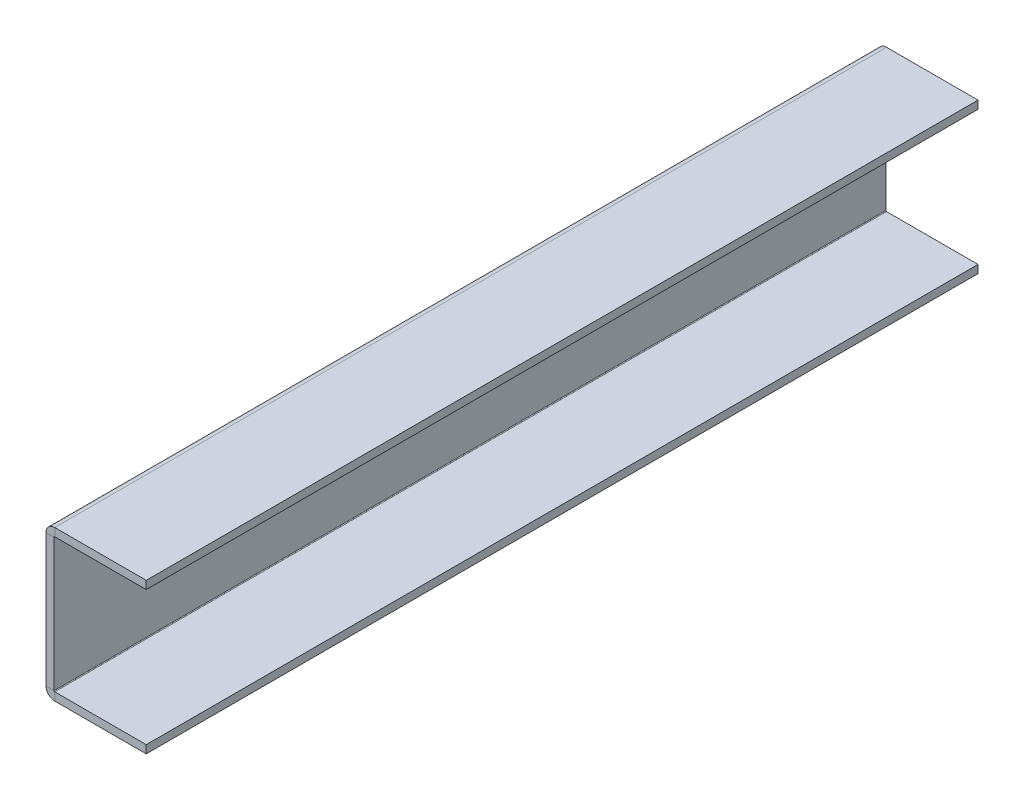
ISO-10303-21;
HEADER;
FILE_DESCRIPTION(('STEP AP214'),'2;1');
FILE_NAME('part.step','',(''),(''),'','','');
FILE_SCHEMA(('AUTOMOTIVE_DESIGN { 1 0 10303 214 1 1 1 1 }'));
ENDSEC;
DATA;
#1=APPLICATION_CONTEXT('core data for automotive mechanical design processes');
#2=APPLICATION_PROTOCOL_DEFINITION('international standard','automotive_design',2000,#1);
#3=PRODUCT_CONTEXT('',#1,'mechanical');
#4=PRODUCT('Part','Part','',(#3));
#5=PRODUCT_RELATED_PRODUCT_CATEGORY('part','',(#4));
#6=PRODUCT_DEFINITION_FORMATION('','',#4);
#7=PRODUCT_DEFINITION_CONTEXT('part definition',#1,'design');
#8=PRODUCT_DEFINITION('design','',#6,#7);
#9=PRODUCT_DEFINITION_SHAPE('','',#8);
#10=(LENGTH_UNIT() NAMED_UNIT(*) SI_UNIT(.MILLI.,.METRE.));
#11=(NAMED_UNIT(*) PLANE_ANGLE_UNIT() SI_UNIT($,.RADIAN.));
#12=(NAMED_UNIT(*) SI_UNIT($,.STERADIAN.) SOLID_ANGLE_UNIT());
#13=UNCERTAINTY_MEASURE_WITH_UNIT(LENGTH_MEASURE(1.E-05),#10,'distance_accuracy_value','');
#14=(GEOMETRIC_REPRESENTATION_CONTEXT(3) GLOBAL_UNCERTAINTY_ASSIGNED_CONTEXT((#13)) GLOBAL_UNIT_ASSIGNED_CONTEXT((#10,
#11,#12)) REPRESENTATION_CONTEXT('',''));
#15=CARTESIAN_POINT('',(0.,0.,0.));
#16=DIRECTION('',(0.,0.,1.));
#17=DIRECTION('',(1.,0.,0.));
#18=AXIS2_PLACEMENT_3D('',#15,#16,#17);
#19=CARTESIAN_POINT('',(0.,-0.7366,830.));
#20=DIRECTION('',(0.,0.,1.));
#21=DIRECTION('',(1.,0.,0.));
#22=AXIS2_PLACEMENT_3D('',#19,#20,#21);
#23=PLANE('',#22);
#24=DIRECTION('',(-1.,0.,0.));
#25=VECTOR('',#24,1.);
#26=CARTESIAN_POINT('',(0.,-0.7366,830.));
#27=LINE('',#26,#25);
#28=CARTESIAN_POINT('',(0.,-0.7366,830.));
#29=VERTEX_POINT('',#28);
#30=CARTESIAN_POINT('',(-8.,-0.736600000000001,830.));
#31=VERTEX_POINT('',#30);
#32=EDGE_CURVE('E11',#29,#31,#27,.T.);
#33=ORIENTED_EDGE('',*,*,#32,.F.);
#34=CARTESIAN_POINT('',(0.736600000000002,-0.7366,830.));
#35=DIRECTION('',(0.,0.,-1.));
#36=DIRECTION('',(-1.,0.,0.));
#37=AXIS2_PLACEMENT_3D('',#34,#35,#36);
#38=CIRCLE('',#37,0.7366);
#39=CARTESIAN_POINT('',(0.736600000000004,0.,830.));
#40=VERTEX_POINT('',#39);
#41=EDGE_CURVE('E251',#40,#29,#38,.F.);
#42=ORIENTED_EDGE('',*,*,#41,.F.);
#43=DIRECTION('',(0.,-1.,0.));
#44=VECTOR('',#43,1.);
#45=CARTESIAN_POINT('',(0.736600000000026,8.,830.));
#46=LINE('',#45,#44);
#47=CARTESIAN_POINT('',(0.736600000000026,8.,830.));
#48=VERTEX_POINT('',#47);
#49=EDGE_CURVE('E49',#48,#40,#46,.T.);
#50=ORIENTED_EDGE('',*,*,#49,.F.);
#51=CARTESIAN_POINT('',(0.736600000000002,-0.7366,830.));
#52=DIRECTION('',(0.,0.,1.));
#53=DIRECTION('',(1.,0.,0.));
#54=AXIS2_PLACEMENT_3D('',#51,#52,#53);
#55=CIRCLE('',#54,8.7366);
#56=EDGE_CURVE('E150',#48,#31,#55,.T.);
#57=ORIENTED_EDGE('',*,*,#56,.T.);
#58=EDGE_LOOP('',(#33,#42,#50,#57));
#59=FACE_BOUND('',#58,.T.);
#60=ADVANCED_FACE('F41',(#59),#23,.T.);
#61=CARTESIAN_POINT('',(0.736600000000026,8.,830.));
#62=DIRECTION('',(0.,0.,1.));
#63=DIRECTION('',(1.,0.,0.));
#64=AXIS2_PLACEMENT_3D('',#61,#62,#63);
#65=PLANE('',#64);
#66=DIRECTION('',(0.,-1.,0.));
#67=VECTOR('',#66,1.);
#68=CARTESIAN_POINT('',(0.,0.,830.));
#69=LINE('',#68,#67);
#70=CARTESIAN_POINT('',(0.,-133.2634,830.));
#71=VERTEX_POINT('',#70);
#72=EDGE_CURVE('E144',#29,#71,#69,.T.);
#73=ORIENTED_EDGE('',*,*,#72,.F.);
#74=ORIENTED_EDGE('',*,*,#32,.T.);
#75=DIRECTION('',(0.,-1.,0.));
#76=VECTOR('',#75,1.);
#77=CARTESIAN_POINT('',(-8.,0.,830.));
#78=LINE('',#77,#76);
#79=CARTESIAN_POINT('',(-7.99999999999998,-133.2634,830.));
#80=VERTEX_POINT('',#79);
#81=EDGE_CURVE('E141',#31,#80,#78,.T.);
#82=ORIENTED_EDGE('',*,*,#81,.T.);
#83=DIRECTION('',(1.,0.,0.));
#84=VECTOR('',#83,1.);
#85=CARTESIAN_POINT('',(-7.99999999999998,-133.2634,830.));
#86=LINE('',#85,#84);
#87=EDGE_CURVE('E232',#80,#71,#86,.T.);
#88=ORIENTED_EDGE('',*,*,#87,.T.);
#89=EDGE_LOOP('',(#73,#74,#82,#88));
#90=FACE_BOUND('',#89,.T.);
#91=ADVANCED_FACE('F139',(#90),#65,.T.);
#92=CARTESIAN_POINT('',(0.736600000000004,0.,0.));
#93=DIRECTION('',(0.,0.,-1.));
#94=DIRECTION('',(-1.,0.,0.));
#95=AXIS2_PLACEMENT_3D('',#92,#93,#94);
#96=PLANE('',#95);
#97=DIRECTION('',(0.,1.,0.));
#98=VECTOR('',#97,1.);
#99=CARTESIAN_POINT('',(0.736600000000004,0.,0.));
#100=LINE('',#99,#98);
#101=CARTESIAN_POINT('',(0.736600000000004,0.,0.));
#102=VERTEX_POINT('',#101);
#103=CARTESIAN_POINT('',(0.736600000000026,8.,0.));
#104=VERTEX_POINT('',#103);
#105=EDGE_CURVE('E237',#102,#104,#100,.T.);
#106=ORIENTED_EDGE('',*,*,#105,.F.);
#107=CARTESIAN_POINT('',(0.736600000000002,-0.7366,0.));
#108=DIRECTION('',(0.,0.,-1.));
#109=DIRECTION('',(-1.,0.,0.));
#110=AXIS2_PLACEMENT_3D('',#107,#108,#109);
#111=CIRCLE('',#110,0.7366);
#112=CARTESIAN_POINT('',(0.,-0.7366,0.));
#113=VERTEX_POINT('',#112);
#114=EDGE_CURVE('E189',#102,#113,#111,.F.);
#115=ORIENTED_EDGE('',*,*,#114,.T.);
#116=DIRECTION('',(1.,0.,0.));
#117=VECTOR('',#116,1.);
#118=CARTESIAN_POINT('',(-8.,-0.736600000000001,0.));
#119=LINE('',#118,#117);
#120=CARTESIAN_POINT('',(-8.,-0.736600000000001,0.));
#121=VERTEX_POINT('',#120);
#122=EDGE_CURVE('E235',#121,#113,#119,.T.);
#123=ORIENTED_EDGE('',*,*,#122,.F.);
#124=CARTESIAN_POINT('',(0.736600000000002,-0.7366,0.));
#125=DIRECTION('',(0.,0.,1.));
#126=DIRECTION('',(1.,0.,0.));
#127=AXIS2_PLACEMENT_3D('',#124,#125,#126);
#128=CIRCLE('',#127,8.7366);
#129=EDGE_CURVE('E162',#104,#121,#128,.T.);
#130=ORIENTED_EDGE('',*,*,#129,.F.);
#131=EDGE_LOOP('',(#106,#115,#123,#130));
#132=FACE_BOUND('',#131,.T.);
#133=ADVANCED_FACE('F289',(#132),#96,.T.);
#134=CARTESIAN_POINT('',(-8.,-0.736600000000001,0.));
#135=DIRECTION('',(0.,0.,-1.));
#136=DIRECTION('',(-1.,0.,0.));
#137=AXIS2_PLACEMENT_3D('',#134,#135,#136);
#138=PLANE('',#137);
#139=DIRECTION('',(-1.,0.,0.));
#140=VECTOR('',#139,1.);
#141=CARTESIAN_POINT('',(92.,0.,0.));
#142=LINE('',#141,#140);
#143=CARTESIAN_POINT('',(92.,0.,0.));
#144=VERTEX_POINT('',#143);
#145=EDGE_CURVE('E192',#144,#102,#142,.T.);
#146=ORIENTED_EDGE('',*,*,#145,.T.);
#147=ORIENTED_EDGE('',*,*,#105,.T.);
#148=DIRECTION('',(-1.,0.,0.));
#149=VECTOR('',#148,1.);
#150=CARTESIAN_POINT('',(92.,8.,0.));
#151=LINE('',#150,#149);
#152=CARTESIAN_POINT('',(92.,8.,0.));
#153=VERTEX_POINT('',#152);
#154=EDGE_CURVE('E198',#153,#104,#151,.T.);
#155=ORIENTED_EDGE('',*,*,#154,.F.);
#156=DIRECTION('',(0.,-1.,0.));
#157=VECTOR('',#156,1.);
#158=CARTESIAN_POINT('',(92.,8.,0.));
#159=LINE('',#158,#157);
#160=EDGE_CURVE('E195',#153,#144,#159,.T.);
#161=ORIENTED_EDGE('',*,*,#160,.T.);
#162=EDGE_LOOP('',(#146,#147,#155,#161));
#163=FACE_BOUND('',#162,.T.);
#164=ADVANCED_FACE('F292',(#163),#138,.T.);
#165=CARTESIAN_POINT('',(0.736600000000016,-134.,830.));
#166=DIRECTION('',(0.,0.,1.));
#167=DIRECTION('',(1.,0.,0.));
#168=AXIS2_PLACEMENT_3D('',#165,#166,#167);
#169=PLANE('',#168);
#170=DIRECTION('',(0.,-1.,0.));
#171=VECTOR('',#170,1.);
#172=CARTESIAN_POINT('',(0.736600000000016,-134.,830.));
#173=LINE('',#172,#171);
#174=CARTESIAN_POINT('',(0.736600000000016,-134.,830.));
#175=VERTEX_POINT('',#174);
#176=CARTESIAN_POINT('',(0.736600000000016,-142.,830.));
#177=VERTEX_POINT('',#176);
#178=EDGE_CURVE('E57',#175,#177,#173,.T.);
#179=ORIENTED_EDGE('',*,*,#178,.F.);
#180=CARTESIAN_POINT('',(0.736600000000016,-133.2634,830.));
#181=DIRECTION('',(0.,0.,-1.));
#182=DIRECTION('',(-1.,0.,0.));
#183=AXIS2_PLACEMENT_3D('',#180,#181,#182);
#184=CIRCLE('',#183,0.7366);
#185=EDGE_CURVE('E261',#71,#175,#184,.F.);
#186=ORIENTED_EDGE('',*,*,#185,.F.);
#187=ORIENTED_EDGE('',*,*,#87,.F.);
#188=CARTESIAN_POINT('',(0.736600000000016,-133.2634,830.));
#189=DIRECTION('',(0.,0.,1.));
#190=DIRECTION('',(1.,0.,0.));
#191=AXIS2_PLACEMENT_3D('',#188,#189,#190);
#192=CIRCLE('',#191,8.7366);
#193=EDGE_CURVE('E170',#80,#177,#192,.T.);
#194=ORIENTED_EDGE('',*,*,#193,.T.);
#195=EDGE_LOOP('',(#179,#186,#187,#194));
#196=FACE_BOUND('',#195,.T.);
#197=ADVANCED_FACE('F284',(#196),#169,.T.);
#198=CARTESIAN_POINT('',(-7.99999999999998,-133.2634,830.));
#199=DIRECTION('',(0.,0.,1.));
#200=DIRECTION('',(1.,0.,0.));
#201=AXIS2_PLACEMENT_3D('',#198,#199,#200);
#202=PLANE('',#201);
#203=DIRECTION('',(1.,0.,0.));
#204=VECTOR('',#203,1.);
#205=CARTESIAN_POINT('',(0.,-134.,830.));
#206=LINE('',#205,#204);
#207=CARTESIAN_POINT('',(92.,-134.,830.));
#208=VERTEX_POINT('',#207);
#209=EDGE_CURVE('E264',#175,#208,#206,.T.);
#210=ORIENTED_EDGE('',*,*,#209,.F.);
#211=ORIENTED_EDGE('',*,*,#178,.T.);
#212=DIRECTION('',(1.,0.,0.));
#213=VECTOR('',#212,1.);
#214=CARTESIAN_POINT('',(0.,-142.,830.));
#215=LINE('',#214,#213);
#216=CARTESIAN_POINT('',(92.,-142.,830.));
#217=VERTEX_POINT('',#216);
#218=EDGE_CURVE('E111',#177,#217,#215,.T.);
#219=ORIENTED_EDGE('',*,*,#218,.T.);
#220=DIRECTION('',(0.,-1.,0.));
#221=VECTOR('',#220,1.);
#222=CARTESIAN_POINT('',(92.,-134.,830.));
#223=LINE('',#222,#221);
#224=EDGE_CURVE('E267',#208,#217,#223,.T.);
#225=ORIENTED_EDGE('',*,*,#224,.F.);
#226=EDGE_LOOP('',(#210,#211,#219,#225));
#227=FACE_BOUND('',#226,.T.);
#228=ADVANCED_FACE('F273',(#227),#202,.T.);
#229=CARTESIAN_POINT('',(0.,-133.2634,0.));
#230=DIRECTION('',(0.,0.,-1.));
#231=DIRECTION('',(-1.,0.,0.));
#232=AXIS2_PLACEMENT_3D('',#229,#230,#231);
#233=PLANE('',#232);
#234=DIRECTION('',(-1.,0.,0.));
#235=VECTOR('',#234,1.);
#236=CARTESIAN_POINT('',(0.,-133.2634,0.));
#237=LINE('',#236,#235);
#238=CARTESIAN_POINT('',(0.,-133.2634,0.));
#239=VERTEX_POINT('',#238);
#240=CARTESIAN_POINT('',(-7.99999999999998,-133.2634,0.));
#241=VERTEX_POINT('',#240);
#242=EDGE_CURVE('E98',#239,#241,#237,.T.);
#243=ORIENTED_EDGE('',*,*,#242,.F.);
#244=CARTESIAN_POINT('',(0.736600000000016,-133.2634,0.));
#245=DIRECTION('',(0.,0.,-1.));
#246=DIRECTION('',(-1.,0.,0.));
#247=AXIS2_PLACEMENT_3D('',#244,#245,#246);
#248=CIRCLE('',#247,0.7366);
#249=CARTESIAN_POINT('',(0.736600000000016,-134.,0.));
#250=VERTEX_POINT('',#249);
#251=EDGE_CURVE('E185',#239,#250,#248,.F.);
#252=ORIENTED_EDGE('',*,*,#251,.T.);
#253=DIRECTION('',(0.,1.,0.));
#254=VECTOR('',#253,1.);
#255=CARTESIAN_POINT('',(0.736600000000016,-142.,0.));
#256=LINE('',#255,#254);
#257=CARTESIAN_POINT('',(0.736600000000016,-142.,0.));
#258=VERTEX_POINT('',#257);
#259=EDGE_CURVE('E105',#258,#250,#256,.T.);
#260=ORIENTED_EDGE('',*,*,#259,.F.);
#261=CARTESIAN_POINT('',(0.736600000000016,-133.2634,0.));
#262=DIRECTION('',(0.,0.,1.));
#263=DIRECTION('',(1.,0.,0.));
#264=AXIS2_PLACEMENT_3D('',#261,#262,#263);
#265=CIRCLE('',#264,8.7366);
#266=EDGE_CURVE('E204',#241,#258,#265,.T.);
#267=ORIENTED_EDGE('',*,*,#266,.F.);
#268=EDGE_LOOP('',(#243,#252,#260,#267));
#269=FACE_BOUND('',#268,.T.);
#270=ADVANCED_FACE('F321',(#269),#233,.T.);
#271=CARTESIAN_POINT('',(0.736600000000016,-142.,0.));
#272=DIRECTION('',(0.,0.,-1.));
#273=DIRECTION('',(-1.,0.,0.));
#274=AXIS2_PLACEMENT_3D('',#271,#272,#273);
#275=PLANE('',#274);
#276=DIRECTION('',(0.,-1.,0.));
#277=VECTOR('',#276,1.);
#278=CARTESIAN_POINT('',(0.,0.,0.));
#279=LINE('',#278,#277);
#280=EDGE_CURVE('E187',#113,#239,#279,.T.);
#281=ORIENTED_EDGE('',*,*,#280,.T.);
#282=ORIENTED_EDGE('',*,*,#242,.T.);
#283=DIRECTION('',(0.,-1.,0.));
#284=VECTOR('',#283,1.);
#285=CARTESIAN_POINT('',(-8.,0.,0.));
#286=LINE('',#285,#284);
#287=EDGE_CURVE('E202',#121,#241,#286,.T.);
#288=ORIENTED_EDGE('',*,*,#287,.F.);
#289=ORIENTED_EDGE('',*,*,#122,.T.);
#290=EDGE_LOOP('',(#281,#282,#288,#289));
#291=FACE_BOUND('',#290,.T.);
#292=ADVANCED_FACE('F324',(#291),#275,.T.);
#293=CARTESIAN_POINT('',(0.,-142.,830.));
#294=DIRECTION('',(0.,1.,0.));
#295=DIRECTION('',(0.,0.,1.));
#296=AXIS2_PLACEMENT_3D('',#293,#294,#295);
#297=PLANE('',#296);
#298=DIRECTION('',(1.,0.,0.));
#299=VECTOR('',#298,1.);
#300=CARTESIAN_POINT('',(0.,-142.,0.));
#301=LINE('',#300,#299);
#302=CARTESIAN_POINT('',(92.,-142.,0.));
#303=VERTEX_POINT('',#302);
#304=EDGE_CURVE('E176',#258,#303,#301,.T.);
#305=ORIENTED_EDGE('',*,*,#304,.T.);
#306=DIRECTION('',(0.,0.,-1.));
#307=VECTOR('',#306,1.);
#308=CARTESIAN_POINT('',(92.,-142.,830.));
#309=LINE('',#308,#307);
#310=EDGE_CURVE('E228',#217,#303,#309,.T.);
#311=ORIENTED_EDGE('',*,*,#310,.F.);
#312=ORIENTED_EDGE('',*,*,#218,.F.);
#313=DIRECTION('',(0.,0.,-1.));
#314=VECTOR('',#313,1.);
#315=CARTESIAN_POINT('',(0.736600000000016,-142.,830.));
#316=LINE('',#315,#314);
#317=EDGE_CURVE('E172',#177,#258,#316,.T.);
#318=ORIENTED_EDGE('',*,*,#317,.T.);
#319=EDGE_LOOP('',(#305,#311,#312,#318));
#320=FACE_BOUND('',#319,.T.);
#321=ADVANCED_FACE('F327',(#320),#297,.F.);
#322=CARTESIAN_POINT('',(92.,-134.,830.));
#323=DIRECTION('',(1.,0.,0.));
#324=DIRECTION('',(0.,0.,-1.));
#325=AXIS2_PLACEMENT_3D('',#322,#323,#324);
#326=PLANE('',#325);
#327=DIRECTION('',(0.,-1.,0.));
#328=VECTOR('',#327,1.);
#329=CARTESIAN_POINT('',(92.,-134.,0.));
#330=LINE('',#329,#328);
#331=CARTESIAN_POINT('',(92.,-134.,0.));
#332=VERTEX_POINT('',#331);
#333=EDGE_CURVE('E179',#332,#303,#330,.T.);
#334=ORIENTED_EDGE('',*,*,#333,.F.);
#335=DIRECTION('',(0.,0.,-1.));
#336=VECTOR('',#335,1.);
#337=CARTESIAN_POINT('',(92.,-134.,830.));
#338=LINE('',#337,#336);
#339=EDGE_CURVE('E226',#208,#332,#338,.T.);
#340=ORIENTED_EDGE('',*,*,#339,.F.);
#341=ORIENTED_EDGE('',*,*,#224,.T.);
#342=ORIENTED_EDGE('',*,*,#310,.T.);
#343=EDGE_LOOP('',(#334,#340,#341,#342));
#344=FACE_BOUND('',#343,.T.);
#345=ADVANCED_FACE('F272',(#344),#326,.T.);
#346=CARTESIAN_POINT('',(0.,-134.,830.));
#347=DIRECTION('',(0.,1.,0.));
#348=DIRECTION('',(0.,0.,1.));
#349=AXIS2_PLACEMENT_3D('',#346,#347,#348);
#350=PLANE('',#349);
#351=DIRECTION('',(1.,0.,0.));
#352=VECTOR('',#351,1.);
#353=CARTESIAN_POINT('',(0.,-134.,0.));
#354=LINE('',#353,#352);
#355=EDGE_CURVE('E182',#250,#332,#354,.T.);
#356=ORIENTED_EDGE('',*,*,#355,.F.);
#357=DIRECTION('',(0.,0.,-1.));
#358=VECTOR('',#357,1.);
#359=CARTESIAN_POINT('',(0.736600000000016,-134.,830.));
#360=LINE('',#359,#358);
#361=EDGE_CURVE('E223',#175,#250,#360,.T.);
#362=ORIENTED_EDGE('',*,*,#361,.F.);
#363=ORIENTED_EDGE('',*,*,#209,.T.);
#364=ORIENTED_EDGE('',*,*,#339,.T.);
#365=EDGE_LOOP('',(#356,#362,#363,#364));
#366=FACE_BOUND('',#365,.T.);
#367=ADVANCED_FACE('F277',(#366),#350,.T.);
#368=CARTESIAN_POINT('',(0.736600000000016,-133.2634,830.));
#369=DIRECTION('',(0.,0.,-1.));
#370=DIRECTION('',(-1.,0.,0.));
#371=AXIS2_PLACEMENT_3D('',#368,#369,#370);
#372=CYLINDRICAL_SURFACE('',#371,0.7366);
#373=ORIENTED_EDGE('',*,*,#251,.F.);
#374=DIRECTION('',(0.,0.,-1.));
#375=VECTOR('',#374,1.);
#376=CARTESIAN_POINT('',(0.,-133.2634,830.));
#377=LINE('',#376,#375);
#378=EDGE_CURVE('E220',#71,#239,#377,.T.);
#379=ORIENTED_EDGE('',*,*,#378,.F.);
#380=ORIENTED_EDGE('',*,*,#185,.T.);
#381=ORIENTED_EDGE('',*,*,#361,.T.);
#382=EDGE_LOOP('',(#373,#379,#380,#381));
#383=FACE_BOUND('',#382,.T.);
#384=ADVANCED_FACE('F280',(#383),#372,.F.);
#385=CARTESIAN_POINT('',(0.,0.,830.));
#386=DIRECTION('',(1.,0.,0.));
#387=DIRECTION('',(0.,1.,0.));
#388=AXIS2_PLACEMENT_3D('',#385,#386,#387);
#389=PLANE('',#388);
#390=ORIENTED_EDGE('',*,*,#280,.F.);
#391=DIRECTION('',(0.,0.,-1.));
#392=VECTOR('',#391,1.);
#393=CARTESIAN_POINT('',(0.,-0.7366,830.));
#394=LINE('',#393,#392);
#395=EDGE_CURVE('E217',#29,#113,#394,.T.);
#396=ORIENTED_EDGE('',*,*,#395,.F.);
#397=ORIENTED_EDGE('',*,*,#72,.T.);
#398=ORIENTED_EDGE('',*,*,#378,.T.);
#399=EDGE_LOOP('',(#390,#396,#397,#398));
#400=FACE_BOUND('',#399,.T.);
#401=ADVANCED_FACE('F287',(#400),#389,.T.);
#402=CARTESIAN_POINT('',(0.736600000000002,-0.7366,830.));
#403=DIRECTION('',(0.,0.,-1.));
#404=DIRECTION('',(-1.,0.,0.));
#405=AXIS2_PLACEMENT_3D('',#402,#403,#404);
#406=CYLINDRICAL_SURFACE('',#405,0.7366);
#407=ORIENTED_EDGE('',*,*,#114,.F.);
#408=DIRECTION('',(0.,0.,-1.));
#409=VECTOR('',#408,1.);
#410=CARTESIAN_POINT('',(0.736600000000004,0.,830.));
#411=LINE('',#410,#409);
#412=EDGE_CURVE('E214',#40,#102,#411,.T.);
#413=ORIENTED_EDGE('',*,*,#412,.F.);
#414=ORIENTED_EDGE('',*,*,#41,.T.);
#415=ORIENTED_EDGE('',*,*,#395,.T.);
#416=EDGE_LOOP('',(#407,#413,#414,#415));
#417=FACE_BOUND('',#416,.T.);
#418=ADVANCED_FACE('F250',(#417),#406,.F.);
#419=CARTESIAN_POINT('',(92.,0.,830.));
#420=DIRECTION('',(0.,-1.,0.));
#421=DIRECTION('',(1.,0.,0.));
#422=AXIS2_PLACEMENT_3D('',#419,#420,#421);
#423=PLANE('',#422);
#424=ORIENTED_EDGE('',*,*,#145,.F.);
#425=DIRECTION('',(0.,0.,-1.));
#426=VECTOR('',#425,1.);
#427=CARTESIAN_POINT('',(92.,0.,830.));
#428=LINE('',#427,#426);
#429=CARTESIAN_POINT('',(92.,0.,830.));
#430=VERTEX_POINT('',#429);
#431=EDGE_CURVE('E212',#430,#144,#428,.T.);
#432=ORIENTED_EDGE('',*,*,#431,.F.);
#433=DIRECTION('',(-1.,0.,0.));
#434=VECTOR('',#433,1.);
#435=CARTESIAN_POINT('',(92.,0.,830.));
#436=LINE('',#435,#434);
#437=EDGE_CURVE('E244',#430,#40,#436,.T.);
#438=ORIENTED_EDGE('',*,*,#437,.T.);
#439=ORIENTED_EDGE('',*,*,#412,.T.);
#440=EDGE_LOOP('',(#424,#432,#438,#439));
#441=FACE_BOUND('',#440,.T.);
#442=ADVANCED_FACE('F255',(#441),#423,.T.);
#443=CARTESIAN_POINT('',(92.,8.,830.));
#444=DIRECTION('',(1.,0.,0.));
#445=DIRECTION('',(0.,0.,-1.));
#446=AXIS2_PLACEMENT_3D('',#443,#444,#445);
#447=PLANE('',#446);
#448=ORIENTED_EDGE('',*,*,#160,.F.);
#449=DIRECTION('',(0.,0.,-1.));
#450=VECTOR('',#449,1.);
#451=CARTESIAN_POINT('',(92.,8.,830.));
#452=LINE('',#451,#450);
#453=CARTESIAN_POINT('',(92.,8.,830.));
#454=VERTEX_POINT('',#453);
#455=EDGE_CURVE('E210',#454,#153,#452,.T.);
#456=ORIENTED_EDGE('',*,*,#455,.F.);
#457=DIRECTION('',(0.,-1.,0.));
#458=VECTOR('',#457,1.);
#459=CARTESIAN_POINT('',(92.,8.,830.));
#460=LINE('',#459,#458);
#461=EDGE_CURVE('E256',#454,#430,#460,.T.);
#462=ORIENTED_EDGE('',*,*,#461,.T.);
#463=ORIENTED_EDGE('',*,*,#431,.T.);
#464=EDGE_LOOP('',(#448,#456,#462,#463));
#465=FACE_BOUND('',#464,.T.);
#466=ADVANCED_FACE('F297',(#465),#447,.T.);
#467=CARTESIAN_POINT('',(92.,8.,830.));
#468=DIRECTION('',(0.,-1.,0.));
#469=DIRECTION('',(1.,0.,0.));
#470=AXIS2_PLACEMENT_3D('',#467,#468,#469);
#471=PLANE('',#470);
#472=ORIENTED_EDGE('',*,*,#154,.T.);
#473=DIRECTION('',(0.,0.,-1.));
#474=VECTOR('',#473,1.);
#475=CARTESIAN_POINT('',(0.736600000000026,8.,830.));
#476=LINE('',#475,#474);
#477=EDGE_CURVE('E164',#48,#104,#476,.T.);
#478=ORIENTED_EDGE('',*,*,#477,.F.);
#479=DIRECTION('',(-1.,0.,0.));
#480=VECTOR('',#479,1.);
#481=CARTESIAN_POINT('',(92.,8.,830.));
#482=LINE('',#481,#480);
#483=EDGE_CURVE('E155',#454,#48,#482,.T.);
#484=ORIENTED_EDGE('',*,*,#483,.F.);
#485=ORIENTED_EDGE('',*,*,#455,.T.);
#486=EDGE_LOOP('',(#472,#478,#484,#485));
#487=FACE_BOUND('',#486,.T.);
#488=ADVANCED_FACE('F295',(#487),#471,.F.);
#489=CARTESIAN_POINT('',(0.736600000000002,-0.7366,830.));
#490=DIRECTION('',(0.,0.,-1.));
#491=DIRECTION('',(-1.,0.,0.));
#492=AXIS2_PLACEMENT_3D('',#489,#490,#491);
#493=CYLINDRICAL_SURFACE('',#492,8.7366);
#494=ORIENTED_EDGE('',*,*,#129,.T.);
#495=DIRECTION('',(0.,0.,-1.));
#496=VECTOR('',#495,1.);
#497=CARTESIAN_POINT('',(-8.,-0.736600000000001,830.));
#498=LINE('',#497,#496);
#499=EDGE_CURVE('E159',#31,#121,#498,.T.);
#500=ORIENTED_EDGE('',*,*,#499,.F.);
#501=ORIENTED_EDGE('',*,*,#56,.F.);
#502=ORIENTED_EDGE('',*,*,#477,.T.);
#503=EDGE_LOOP('',(#494,#500,#501,#502));
#504=FACE_BOUND('',#503,.T.);
#505=ADVANCED_FACE('F160',(#504),#493,.T.);
#506=CARTESIAN_POINT('',(-8.,0.,830.));
#507=DIRECTION('',(1.,0.,0.));
#508=DIRECTION('',(0.,1.,0.));
#509=AXIS2_PLACEMENT_3D('',#506,#507,#508);
#510=PLANE('',#509);
#511=ORIENTED_EDGE('',*,*,#287,.T.);
#512=DIRECTION('',(0.,0.,-1.));
#513=VECTOR('',#512,1.);
#514=CARTESIAN_POINT('',(-7.99999999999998,-133.2634,830.));
#515=LINE('',#514,#513);
#516=EDGE_CURVE('E165',#80,#241,#515,.T.);
#517=ORIENTED_EDGE('',*,*,#516,.F.);
#518=ORIENTED_EDGE('',*,*,#81,.F.);
#519=ORIENTED_EDGE('',*,*,#499,.T.);
#520=EDGE_LOOP('',(#511,#517,#518,#519));
#521=FACE_BOUND('',#520,.T.);
#522=ADVANCED_FACE('F167',(#521),#510,.F.);
#523=CARTESIAN_POINT('',(0.736600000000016,-133.2634,830.));
#524=DIRECTION('',(0.,0.,-1.));
#525=DIRECTION('',(-1.,0.,0.));
#526=AXIS2_PLACEMENT_3D('',#523,#524,#525);
#527=CYLINDRICAL_SURFACE('',#526,8.7366);
#528=ORIENTED_EDGE('',*,*,#266,.T.);
#529=ORIENTED_EDGE('',*,*,#317,.F.);
#530=ORIENTED_EDGE('',*,*,#193,.F.);
#531=ORIENTED_EDGE('',*,*,#516,.T.);
#532=EDGE_LOOP('',(#528,#529,#530,#531));
#533=FACE_BOUND('',#532,.T.);
#534=ADVANCED_FACE('F379',(#533),#527,.T.);
#535=CARTESIAN_POINT('',(0.736600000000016,-133.2634,830.));
#536=DIRECTION('',(0.,0.,-1.));
#537=DIRECTION('',(-1.,0.,0.));
#538=AXIS2_PLACEMENT_3D('',#535,#536,#537);
#539=PLANE('',#538);
#540=ORIENTED_EDGE('',*,*,#483,.T.);
#541=ORIENTED_EDGE('',*,*,#49,.T.);
#542=ORIENTED_EDGE('',*,*,#437,.F.);
#543=ORIENTED_EDGE('',*,*,#461,.F.);
#544=EDGE_LOOP('',(#540,#541,#542,#543));
#545=FACE_BOUND('',#544,.T.);
#546=ADVANCED_FACE('F241',(#545),#539,.F.);
#547=CARTESIAN_POINT('',(0.736600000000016,-133.2634,0.));
#548=DIRECTION('',(0.,0.,-1.));
#549=DIRECTION('',(-1.,0.,0.));
#550=AXIS2_PLACEMENT_3D('',#547,#548,#549);
#551=PLANE('',#550);
#552=ORIENTED_EDGE('',*,*,#304,.F.);
#553=ORIENTED_EDGE('',*,*,#259,.T.);
#554=ORIENTED_EDGE('',*,*,#355,.T.);
#555=ORIENTED_EDGE('',*,*,#333,.T.);
#556=EDGE_LOOP('',(#552,#553,#554,#555));
#557=FACE_BOUND('',#556,.T.);
#558=ADVANCED_FACE('F399',(#557),#551,.T.);
#559=CLOSED_SHELL('',(#60,#91,#133,#164,#197,#228,#270,#292,#321,#345,#367,#384,#401,#418,#442,
#466,#488,#505,#522,#534,#546,#558));
#560=MANIFOLD_SOLID_BREP('B2',#559);
#561=ADVANCED_BREP_SHAPE_REPRESENTATION('',(#18,#560),#14);
#562=SHAPE_DEFINITION_REPRESENTATION(#9,#561);
ENDSEC;
END-ISO-10303-21;
